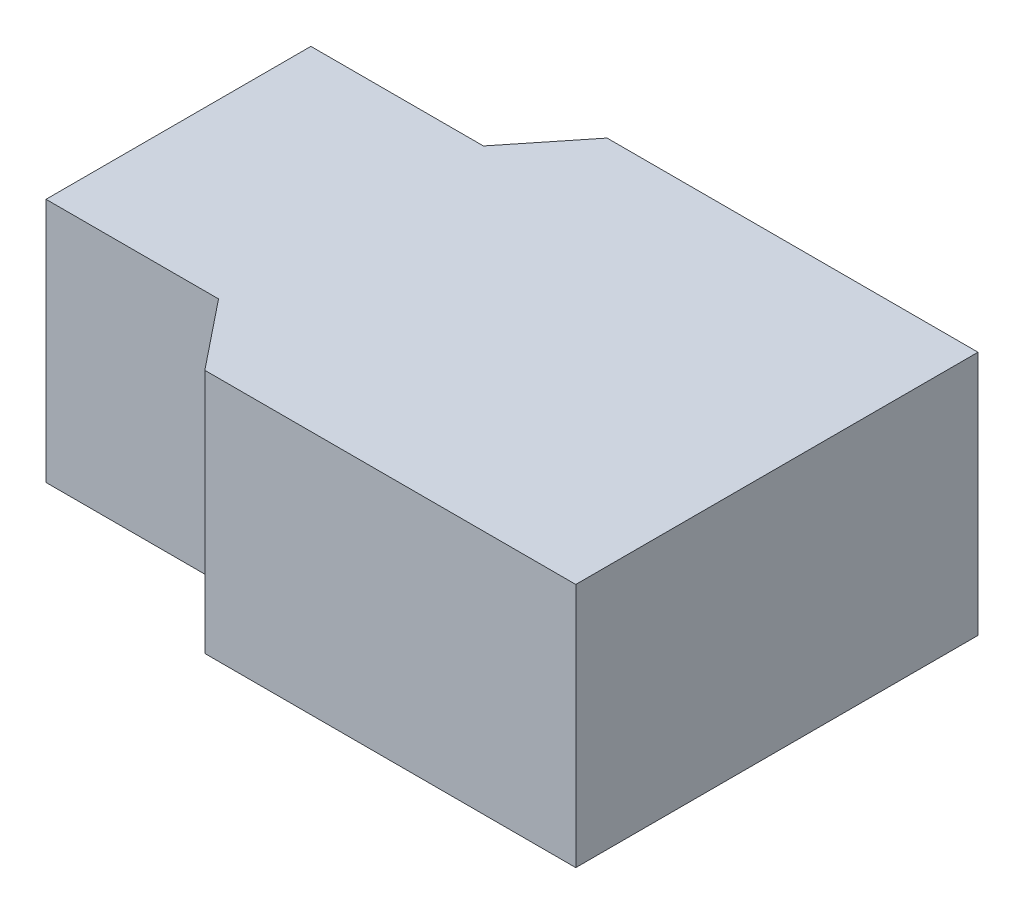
ISO-10303-21;
HEADER;
FILE_DESCRIPTION(('STEP AP214'),'2;1');
FILE_NAME('part.step','',(''),(''),'','','');
FILE_SCHEMA(('AUTOMOTIVE_DESIGN { 1 0 10303 214 1 1 1 1 }'));
ENDSEC;
DATA;
#1=APPLICATION_CONTEXT('core data for automotive mechanical design processes');
#2=APPLICATION_PROTOCOL_DEFINITION('international standard','automotive_design',2000,#1);
#3=PRODUCT_CONTEXT('',#1,'mechanical');
#4=PRODUCT('Part','Part','',(#3));
#5=PRODUCT_RELATED_PRODUCT_CATEGORY('part','',(#4));
#6=PRODUCT_DEFINITION_FORMATION('','',#4);
#7=PRODUCT_DEFINITION_CONTEXT('part definition',#1,'design');
#8=PRODUCT_DEFINITION('design','',#6,#7);
#9=PRODUCT_DEFINITION_SHAPE('','',#8);
#10=(LENGTH_UNIT() NAMED_UNIT(*) SI_UNIT(.MILLI.,.METRE.));
#11=(NAMED_UNIT(*) PLANE_ANGLE_UNIT() SI_UNIT($,.RADIAN.));
#12=(NAMED_UNIT(*) SI_UNIT($,.STERADIAN.) SOLID_ANGLE_UNIT());
#13=UNCERTAINTY_MEASURE_WITH_UNIT(LENGTH_MEASURE(1.E-05),#10,'distance_accuracy_value','');
#14=(GEOMETRIC_REPRESENTATION_CONTEXT(3) GLOBAL_UNCERTAINTY_ASSIGNED_CONTEXT((#13)) GLOBAL_UNIT_ASSIGNED_CONTEXT((#10,
#11,#12)) REPRESENTATION_CONTEXT('',''));
#15=CARTESIAN_POINT('',(0.,0.,0.));
#16=DIRECTION('',(0.,0.,1.));
#17=DIRECTION('',(1.,0.,0.));
#18=AXIS2_PLACEMENT_3D('',#15,#16,#17);
#19=CARTESIAN_POINT('',(-2.89809535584,0.,0.43));
#20=DIRECTION('',(-0.780618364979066,0.,-0.625007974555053));
#21=DIRECTION('',(-0.625007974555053,0.,0.780618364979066));
#22=AXIS2_PLACEMENT_3D('',#19,#20,#21);
#23=PLANE('',#22);
#24=DIRECTION('',(0.,1.,0.));
#25=VECTOR('',#24,1.);
#26=CARTESIAN_POINT('',(-2.954141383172,0.,0.5));
#27=LINE('',#26,#25);
#28=CARTESIAN_POINT('',(-2.954141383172,0.,0.5));
#29=VERTEX_POINT('',#28);
#30=CARTESIAN_POINT('',(-2.954141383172,0.25,0.5));
#31=VERTEX_POINT('',#30);
#32=EDGE_CURVE('E11',#29,#31,#27,.T.);
#33=ORIENTED_EDGE('',*,*,#32,.T.);
#34=DIRECTION('',(-0.625007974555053,0.,0.780618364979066));
#35=VECTOR('',#34,1.);
#36=CARTESIAN_POINT('',(-2.89809535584,0.25,0.43));
#37=LINE('',#36,#35);
#38=CARTESIAN_POINT('',(-2.89809535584,0.25,0.43));
#39=VERTEX_POINT('',#38);
#40=EDGE_CURVE('E25',#39,#31,#37,.T.);
#41=ORIENTED_EDGE('',*,*,#40,.F.);
#42=DIRECTION('',(0.,1.,0.));
#43=VECTOR('',#42,1.);
#44=CARTESIAN_POINT('',(-2.89809535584,0.,0.43));
#45=LINE('',#44,#43);
#46=CARTESIAN_POINT('',(-2.89809535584,0.,0.43));
#47=VERTEX_POINT('',#46);
#48=EDGE_CURVE('E99',#47,#39,#45,.T.);
#49=ORIENTED_EDGE('',*,*,#48,.F.);
#50=DIRECTION('',(-0.625007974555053,0.,0.780618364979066));
#51=VECTOR('',#50,1.);
#52=CARTESIAN_POINT('',(-2.89809535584,0.,0.43));
#53=LINE('',#52,#51);
#54=EDGE_CURVE('E162',#47,#29,#53,.T.);
#55=ORIENTED_EDGE('',*,*,#54,.T.);
#56=EDGE_LOOP('',(#33,#41,#49,#55));
#57=FACE_BOUND('',#56,.T.);
#58=ADVANCED_FACE('F17',(#57),#23,.T.);
#59=CARTESIAN_POINT('',(0.,0.,0.));
#60=DIRECTION('',(0.,1.,0.));
#61=DIRECTION('',(1.,0.,0.));
#62=AXIS2_PLACEMENT_3D('',#59,#60,#61);
#63=PLANE('',#62);
#64=ORIENTED_EDGE('',*,*,#54,.F.);
#65=DIRECTION('',(-1.,0.,0.));
#66=VECTOR('',#65,1.);
#67=CARTESIAN_POINT('',(-2.52,0.,0.43));
#68=LINE('',#67,#66);
#69=CARTESIAN_POINT('',(-2.52,0.,0.43));
#70=VERTEX_POINT('',#69);
#71=EDGE_CURVE('E158',#70,#47,#68,.T.);
#72=ORIENTED_EDGE('',*,*,#71,.F.);
#73=DIRECTION('',(0.,0.,-1.));
#74=VECTOR('',#73,1.);
#75=CARTESIAN_POINT('',(-2.52,0.,0.84));
#76=LINE('',#75,#74);
#77=CARTESIAN_POINT('',(-2.52,0.,0.84));
#78=VERTEX_POINT('',#77);
#79=EDGE_CURVE('E93',#78,#70,#76,.T.);
#80=ORIENTED_EDGE('',*,*,#79,.F.);
#81=DIRECTION('',(1.,0.,0.));
#82=VECTOR('',#81,1.);
#83=CARTESIAN_POINT('',(-2.89809535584,0.,0.84));
#84=LINE('',#83,#82);
#85=CARTESIAN_POINT('',(-2.89809535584,0.,0.84));
#86=VERTEX_POINT('',#85);
#87=EDGE_CURVE('E150',#86,#78,#84,.T.);
#88=ORIENTED_EDGE('',*,*,#87,.F.);
#89=DIRECTION('',(0.625007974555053,0.,0.780618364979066));
#90=VECTOR('',#89,1.);
#91=CARTESIAN_POINT('',(-2.954141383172,0.,0.77));
#92=LINE('',#91,#90);
#93=CARTESIAN_POINT('',(-2.954141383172,0.,0.77));
#94=VERTEX_POINT('',#93);
#95=EDGE_CURVE('E145',#94,#86,#92,.T.);
#96=ORIENTED_EDGE('',*,*,#95,.F.);
#97=DIRECTION('',(1.,0.,0.));
#98=VECTOR('',#97,1.);
#99=CARTESIAN_POINT('',(-3.13,0.,0.77));
#100=LINE('',#99,#98);
#101=CARTESIAN_POINT('',(-3.13,0.,0.77));
#102=VERTEX_POINT('',#101);
#103=EDGE_CURVE('E140',#102,#94,#100,.T.);
#104=ORIENTED_EDGE('',*,*,#103,.F.);
#105=DIRECTION('',(0.,0.,1.));
#106=VECTOR('',#105,1.);
#107=CARTESIAN_POINT('',(-3.13,0.,0.5));
#108=LINE('',#107,#106);
#109=CARTESIAN_POINT('',(-3.13,0.,0.5));
#110=VERTEX_POINT('',#109);
#111=EDGE_CURVE('E135',#110,#102,#108,.T.);
#112=ORIENTED_EDGE('',*,*,#111,.F.);
#113=DIRECTION('',(-1.,0.,0.));
#114=VECTOR('',#113,1.);
#115=CARTESIAN_POINT('',(-2.954141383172,0.,0.5));
#116=LINE('',#115,#114);
#117=EDGE_CURVE('E130',#29,#110,#116,.T.);
#118=ORIENTED_EDGE('',*,*,#117,.F.);
#119=EDGE_LOOP('',(#64,#72,#80,#88,#96,#104,#112,#118));
#120=FACE_BOUND('',#119,.T.);
#121=ADVANCED_FACE('F211',(#120),#63,.F.);
#122=CARTESIAN_POINT('',(-2.954141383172,0.,0.5));
#123=DIRECTION('',(0.,0.,-1.));
#124=DIRECTION('',(-1.,0.,0.));
#125=AXIS2_PLACEMENT_3D('',#122,#123,#124);
#126=PLANE('',#125);
#127=DIRECTION('',(0.,1.,0.));
#128=VECTOR('',#127,1.);
#129=CARTESIAN_POINT('',(-3.13,0.,0.5));
#130=LINE('',#129,#128);
#131=CARTESIAN_POINT('',(-3.13,0.25,0.5));
#132=VERTEX_POINT('',#131);
#133=EDGE_CURVE('E126',#110,#132,#130,.T.);
#134=ORIENTED_EDGE('',*,*,#133,.T.);
#135=DIRECTION('',(-1.,0.,0.));
#136=VECTOR('',#135,1.);
#137=CARTESIAN_POINT('',(-2.954141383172,0.25,0.5));
#138=LINE('',#137,#136);
#139=EDGE_CURVE('E121',#31,#132,#138,.T.);
#140=ORIENTED_EDGE('',*,*,#139,.F.);
#141=ORIENTED_EDGE('',*,*,#32,.F.);
#142=ORIENTED_EDGE('',*,*,#117,.T.);
#143=EDGE_LOOP('',(#134,#140,#141,#142));
#144=FACE_BOUND('',#143,.T.);
#145=ADVANCED_FACE('F176',(#144),#126,.T.);
#146=CARTESIAN_POINT('',(0.,0.25,0.));
#147=DIRECTION('',(0.,1.,0.));
#148=DIRECTION('',(1.,0.,0.));
#149=AXIS2_PLACEMENT_3D('',#146,#147,#148);
#150=PLANE('',#149);
#151=DIRECTION('',(0.,0.,1.));
#152=VECTOR('',#151,1.);
#153=CARTESIAN_POINT('',(-3.13,0.25,0.5));
#154=LINE('',#153,#152);
#155=CARTESIAN_POINT('',(-3.13,0.25,0.77));
#156=VERTEX_POINT('',#155);
#157=EDGE_CURVE('E117',#132,#156,#154,.T.);
#158=ORIENTED_EDGE('',*,*,#157,.T.);
#159=DIRECTION('',(1.,0.,0.));
#160=VECTOR('',#159,1.);
#161=CARTESIAN_POINT('',(-3.13,0.25,0.77));
#162=LINE('',#161,#160);
#163=CARTESIAN_POINT('',(-2.954141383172,0.25,0.77));
#164=VERTEX_POINT('',#163);
#165=EDGE_CURVE('E113',#156,#164,#162,.T.);
#166=ORIENTED_EDGE('',*,*,#165,.T.);
#167=DIRECTION('',(0.625007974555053,0.,0.780618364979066));
#168=VECTOR('',#167,1.);
#169=CARTESIAN_POINT('',(-2.954141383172,0.25,0.77));
#170=LINE('',#169,#168);
#171=CARTESIAN_POINT('',(-2.89809535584,0.25,0.84));
#172=VERTEX_POINT('',#171);
#173=EDGE_CURVE('E109',#164,#172,#170,.T.);
#174=ORIENTED_EDGE('',*,*,#173,.T.);
#175=DIRECTION('',(1.,0.,0.));
#176=VECTOR('',#175,1.);
#177=CARTESIAN_POINT('',(-2.89809535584,0.25,0.84));
#178=LINE('',#177,#176);
#179=CARTESIAN_POINT('',(-2.52,0.25,0.84));
#180=VERTEX_POINT('',#179);
#181=EDGE_CURVE('E84',#172,#180,#178,.T.);
#182=ORIENTED_EDGE('',*,*,#181,.T.);
#183=DIRECTION('',(0.,0.,-1.));
#184=VECTOR('',#183,1.);
#185=CARTESIAN_POINT('',(-2.52,0.25,0.84));
#186=LINE('',#185,#184);
#187=CARTESIAN_POINT('',(-2.52,0.25,0.43));
#188=VERTEX_POINT('',#187);
#189=EDGE_CURVE('E77',#180,#188,#186,.T.);
#190=ORIENTED_EDGE('',*,*,#189,.T.);
#191=DIRECTION('',(-1.,0.,0.));
#192=VECTOR('',#191,1.);
#193=CARTESIAN_POINT('',(-2.52,0.25,0.43));
#194=LINE('',#193,#192);
#195=EDGE_CURVE('E81',#188,#39,#194,.T.);
#196=ORIENTED_EDGE('',*,*,#195,.T.);
#197=ORIENTED_EDGE('',*,*,#40,.T.);
#198=ORIENTED_EDGE('',*,*,#139,.T.);
#199=EDGE_LOOP('',(#158,#166,#174,#182,#190,#196,#197,#198));
#200=FACE_BOUND('',#199,.T.);
#201=ADVANCED_FACE('F79',(#200),#150,.T.);
#202=CARTESIAN_POINT('',(-2.52,0.,0.43));
#203=DIRECTION('',(0.,0.,-1.));
#204=DIRECTION('',(-1.,0.,0.));
#205=AXIS2_PLACEMENT_3D('',#202,#203,#204);
#206=PLANE('',#205);
#207=ORIENTED_EDGE('',*,*,#48,.T.);
#208=ORIENTED_EDGE('',*,*,#195,.F.);
#209=DIRECTION('',(0.,1.,0.));
#210=VECTOR('',#209,1.);
#211=CARTESIAN_POINT('',(-2.52,0.,0.43));
#212=LINE('',#211,#210);
#213=EDGE_CURVE('E91',#70,#188,#212,.T.);
#214=ORIENTED_EDGE('',*,*,#213,.F.);
#215=ORIENTED_EDGE('',*,*,#71,.T.);
#216=EDGE_LOOP('',(#207,#208,#214,#215));
#217=FACE_BOUND('',#216,.T.);
#218=ADVANCED_FACE('F98',(#217),#206,.T.);
#219=CARTESIAN_POINT('',(-2.52,0.,0.84));
#220=DIRECTION('',(1.,0.,0.));
#221=DIRECTION('',(0.,0.,-1.));
#222=AXIS2_PLACEMENT_3D('',#219,#220,#221);
#223=PLANE('',#222);
#224=ORIENTED_EDGE('',*,*,#213,.T.);
#225=ORIENTED_EDGE('',*,*,#189,.F.);
#226=DIRECTION('',(0.,1.,0.));
#227=VECTOR('',#226,1.);
#228=CARTESIAN_POINT('',(-2.52,0.,0.84));
#229=LINE('',#228,#227);
#230=EDGE_CURVE('E96',#78,#180,#229,.T.);
#231=ORIENTED_EDGE('',*,*,#230,.F.);
#232=ORIENTED_EDGE('',*,*,#79,.T.);
#233=EDGE_LOOP('',(#224,#225,#231,#232));
#234=FACE_BOUND('',#233,.T.);
#235=ADVANCED_FACE('F92',(#234),#223,.T.);
#236=CARTESIAN_POINT('',(-2.89809535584,0.,0.84));
#237=DIRECTION('',(0.,0.,1.));
#238=DIRECTION('',(1.,0.,0.));
#239=AXIS2_PLACEMENT_3D('',#236,#237,#238);
#240=PLANE('',#239);
#241=ORIENTED_EDGE('',*,*,#230,.T.);
#242=ORIENTED_EDGE('',*,*,#181,.F.);
#243=DIRECTION('',(0.,1.,0.));
#244=VECTOR('',#243,1.);
#245=CARTESIAN_POINT('',(-2.89809535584,0.,0.84));
#246=LINE('',#245,#244);
#247=EDGE_CURVE('E194',#86,#172,#246,.T.);
#248=ORIENTED_EDGE('',*,*,#247,.F.);
#249=ORIENTED_EDGE('',*,*,#87,.T.);
#250=EDGE_LOOP('',(#241,#242,#248,#249));
#251=FACE_BOUND('',#250,.T.);
#252=ADVANCED_FACE('F198',(#251),#240,.T.);
#253=CARTESIAN_POINT('',(-2.954141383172,0.,0.77));
#254=DIRECTION('',(-0.780618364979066,0.,0.625007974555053));
#255=DIRECTION('',(0.625007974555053,0.,0.780618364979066));
#256=AXIS2_PLACEMENT_3D('',#253,#254,#255);
#257=PLANE('',#256);
#258=ORIENTED_EDGE('',*,*,#247,.T.);
#259=ORIENTED_EDGE('',*,*,#173,.F.);
#260=DIRECTION('',(0.,1.,0.));
#261=VECTOR('',#260,1.);
#262=CARTESIAN_POINT('',(-2.954141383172,0.,0.77));
#263=LINE('',#262,#261);
#264=EDGE_CURVE('E185',#94,#164,#263,.T.);
#265=ORIENTED_EDGE('',*,*,#264,.F.);
#266=ORIENTED_EDGE('',*,*,#95,.T.);
#267=EDGE_LOOP('',(#258,#259,#265,#266));
#268=FACE_BOUND('',#267,.T.);
#269=ADVANCED_FACE('F195',(#268),#257,.T.);
#270=CARTESIAN_POINT('',(-3.13,0.,0.77));
#271=DIRECTION('',(0.,0.,1.));
#272=DIRECTION('',(1.,0.,0.));
#273=AXIS2_PLACEMENT_3D('',#270,#271,#272);
#274=PLANE('',#273);
#275=ORIENTED_EDGE('',*,*,#264,.T.);
#276=ORIENTED_EDGE('',*,*,#165,.F.);
#277=DIRECTION('',(0.,1.,0.));
#278=VECTOR('',#277,1.);
#279=CARTESIAN_POINT('',(-3.13,0.,0.77));
#280=LINE('',#279,#278);
#281=EDGE_CURVE('E182',#102,#156,#280,.T.);
#282=ORIENTED_EDGE('',*,*,#281,.F.);
#283=ORIENTED_EDGE('',*,*,#103,.T.);
#284=EDGE_LOOP('',(#275,#276,#282,#283));
#285=FACE_BOUND('',#284,.T.);
#286=ADVANCED_FACE('F188',(#285),#274,.T.);
#287=CARTESIAN_POINT('',(-3.13,0.,0.5));
#288=DIRECTION('',(-1.,0.,0.));
#289=DIRECTION('',(0.,0.,1.));
#290=AXIS2_PLACEMENT_3D('',#287,#288,#289);
#291=PLANE('',#290);
#292=ORIENTED_EDGE('',*,*,#281,.T.);
#293=ORIENTED_EDGE('',*,*,#157,.F.);
#294=ORIENTED_EDGE('',*,*,#133,.F.);
#295=ORIENTED_EDGE('',*,*,#111,.T.);
#296=EDGE_LOOP('',(#292,#293,#294,#295));
#297=FACE_BOUND('',#296,.T.);
#298=ADVANCED_FACE('F180',(#297),#291,.T.);
#299=CLOSED_SHELL('',(#58,#121,#145,#201,#218,#235,#252,#269,#286,#298));
#300=MANIFOLD_SOLID_BREP('B1',#299);
#301=ADVANCED_BREP_SHAPE_REPRESENTATION('',(#18,#300),#14);
#302=SHAPE_DEFINITION_REPRESENTATION(#9,#301);
ENDSEC;
END-ISO-10303-21;
